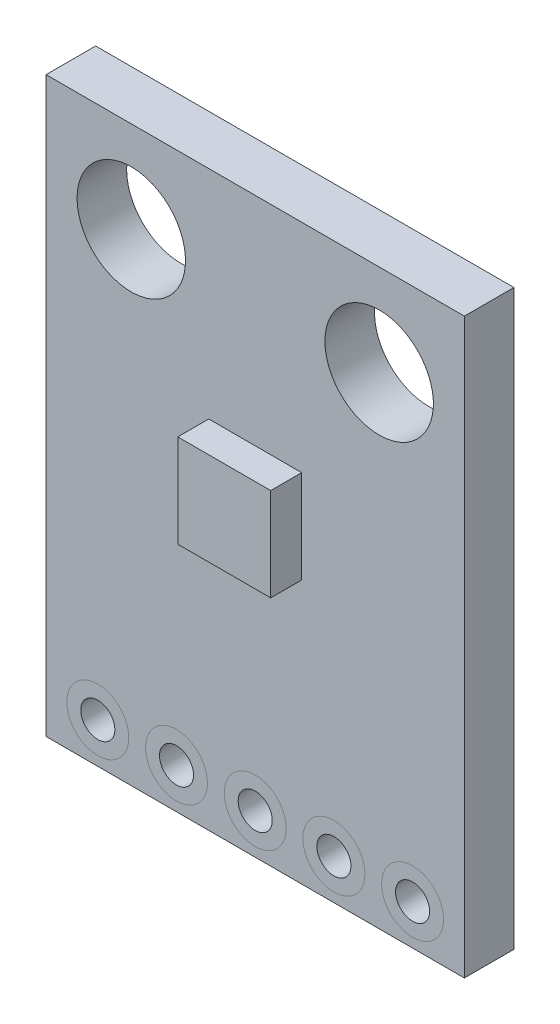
ISO-10303-21;
HEADER;
FILE_DESCRIPTION(('STEP AP214'),'2;1');
FILE_NAME('part.step','',(''),(''),'','','');
FILE_SCHEMA(('AUTOMOTIVE_DESIGN { 1 0 10303 214 1 1 1 1 }'));
ENDSEC;
DATA;
#1=APPLICATION_CONTEXT('core data for automotive mechanical design processes');
#2=APPLICATION_PROTOCOL_DEFINITION('international standard','automotive_design',2000,#1);
#3=PRODUCT_CONTEXT('',#1,'mechanical');
#4=PRODUCT('Part','Part','',(#3));
#5=PRODUCT_RELATED_PRODUCT_CATEGORY('part','',(#4));
#6=PRODUCT_DEFINITION_FORMATION('','',#4);
#7=PRODUCT_DEFINITION_CONTEXT('part definition',#1,'design');
#8=PRODUCT_DEFINITION('design','',#6,#7);
#9=PRODUCT_DEFINITION_SHAPE('','',#8);
#10=(LENGTH_UNIT() NAMED_UNIT(*) SI_UNIT(.MILLI.,.METRE.));
#11=(NAMED_UNIT(*) PLANE_ANGLE_UNIT() SI_UNIT($,.RADIAN.));
#12=(NAMED_UNIT(*) SI_UNIT($,.STERADIAN.) SOLID_ANGLE_UNIT());
#13=UNCERTAINTY_MEASURE_WITH_UNIT(LENGTH_MEASURE(1.E-05),#10,'distance_accuracy_value','');
#14=(GEOMETRIC_REPRESENTATION_CONTEXT(3) GLOBAL_UNCERTAINTY_ASSIGNED_CONTEXT((#13)) GLOBAL_UNIT_ASSIGNED_CONTEXT((#10,
#11,#12)) REPRESENTATION_CONTEXT('',''));
#15=CARTESIAN_POINT('',(0.,0.,0.));
#16=DIRECTION('',(0.,0.,1.));
#17=DIRECTION('',(1.,0.,0.));
#18=AXIS2_PLACEMENT_3D('',#15,#16,#17);
#19=CARTESIAN_POINT('',(13.7500001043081,29.7500005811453,-1.6));
#20=DIRECTION('',(0.,0.,1.));
#21=DIRECTION('',(1.,0.,0.));
#22=AXIS2_PLACEMENT_3D('',#19,#20,#21);
#23=PLANE('',#22);
#24=CARTESIAN_POINT('',(16.2900001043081,21.8000005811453,-1.6));
#25=DIRECTION('',(0.,0.,-1.));
#26=DIRECTION('',(-1.,0.,0.));
#27=AXIS2_PLACEMENT_3D('',#24,#25,#26);
#28=CIRCLE('',#27,1.);
#29=CARTESIAN_POINT('',(15.2900001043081,21.8000005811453,-1.6));
#30=VERTEX_POINT('',#29);
#31=EDGE_CURVE('P0_E99',#30,#30,#28,.F.);
#32=ORIENTED_EDGE('',*,*,#31,.T.);
#33=EDGE_LOOP('',(#32));
#34=FACE_BOUND('',#33,.T.);
#35=CARTESIAN_POINT('',(9.74999946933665,36.0499238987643,-1.6));
#36=DIRECTION('',(0.,0.,-1.));
#37=DIRECTION('',(-1.,0.,0.));
#38=AXIS2_PLACEMENT_3D('',#35,#36,#37);
#39=CIRCLE('',#38,1.75);
#40=CARTESIAN_POINT('',(7.99999946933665,36.0499238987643,-1.6));
#41=VERTEX_POINT('',#40);
#42=EDGE_CURVE('P0_E103',#41,#41,#39,.F.);
#43=ORIENTED_EDGE('',*,*,#42,.T.);
#44=EDGE_LOOP('',(#43));
#45=FACE_BOUND('',#44,.T.);
#46=CARTESIAN_POINT('',(11.2100001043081,21.8000005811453,-1.6));
#47=DIRECTION('',(0.,0.,-1.));
#48=DIRECTION('',(-1.,0.,0.));
#49=AXIS2_PLACEMENT_3D('',#46,#47,#48);
#50=CIRCLE('',#49,1.);
#51=CARTESIAN_POINT('',(10.2100001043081,21.8000005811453,-1.6));
#52=VERTEX_POINT('',#51);
#53=EDGE_CURVE('P0_E106',#52,#52,#50,.F.);
#54=ORIENTED_EDGE('',*,*,#53,.T.);
#55=EDGE_LOOP('',(#54));
#56=FACE_BOUND('',#55,.T.);
#57=CARTESIAN_POINT('',(8.67000010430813,21.8000005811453,-1.6));
#58=DIRECTION('',(0.,0.,-1.));
#59=DIRECTION('',(-1.,0.,0.));
#60=AXIS2_PLACEMENT_3D('',#57,#58,#59);
#61=CIRCLE('',#60,1.);
#62=CARTESIAN_POINT('',(7.67000010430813,21.8000005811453,-1.6));
#63=VERTEX_POINT('',#62);
#64=EDGE_CURVE('P0_E109',#63,#63,#61,.F.);
#65=ORIENTED_EDGE('',*,*,#64,.T.);
#66=EDGE_LOOP('',(#65));
#67=FACE_BOUND('',#66,.T.);
#68=CARTESIAN_POINT('',(17.7500001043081,36.0499230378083,-1.6));
#69=DIRECTION('',(0.,0.,-1.));
#70=DIRECTION('',(-1.,0.,0.));
#71=AXIS2_PLACEMENT_3D('',#68,#69,#70);
#72=CIRCLE('',#71,1.75);
#73=CARTESIAN_POINT('',(16.0000001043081,36.0499230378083,-1.6));
#74=VERTEX_POINT('',#73);
#75=EDGE_CURVE('P0_E112',#74,#74,#72,.F.);
#76=ORIENTED_EDGE('',*,*,#75,.T.);
#77=EDGE_LOOP('',(#76));
#78=FACE_BOUND('',#77,.T.);
#79=CARTESIAN_POINT('',(13.7500001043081,21.8000005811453,-1.6));
#80=DIRECTION('',(0.,0.,-1.));
#81=DIRECTION('',(-1.,0.,0.));
#82=AXIS2_PLACEMENT_3D('',#79,#80,#81);
#83=CIRCLE('',#82,1.);
#84=CARTESIAN_POINT('',(12.7500001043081,21.8000005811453,-1.6));
#85=VERTEX_POINT('',#84);
#86=EDGE_CURVE('P0_E114',#85,#85,#83,.F.);
#87=ORIENTED_EDGE('',*,*,#86,.T.);
#88=EDGE_LOOP('',(#87));
#89=FACE_BOUND('',#88,.T.);
#90=CARTESIAN_POINT('',(18.8300001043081,21.8000005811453,-1.6));
#91=DIRECTION('',(0.,0.,-1.));
#92=DIRECTION('',(-1.,0.,0.));
#93=AXIS2_PLACEMENT_3D('',#90,#91,#92);
#94=CIRCLE('',#93,1.);
#95=CARTESIAN_POINT('',(17.8300001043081,21.8000005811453,-1.6));
#96=VERTEX_POINT('',#95);
#97=EDGE_CURVE('P0_E20',#96,#96,#94,.F.);
#98=ORIENTED_EDGE('',*,*,#97,.T.);
#99=EDGE_LOOP('',(#98));
#100=FACE_BOUND('',#99,.T.);
#101=DIRECTION('',(0.,1.,0.));
#102=VECTOR('',#101,1.);
#103=CARTESIAN_POINT('',(7.00000010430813,20.5000005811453,-1.6));
#104=LINE('',#103,#102);
#105=CARTESIAN_POINT('',(7.00000010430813,39.0000002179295,-1.6));
#106=VERTEX_POINT('',#105);
#107=CARTESIAN_POINT('',(7.00000010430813,20.5000005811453,-1.6));
#108=VERTEX_POINT('',#107);
#109=EDGE_CURVE('P0_E121',#106,#108,#104,.F.);
#110=ORIENTED_EDGE('',*,*,#109,.F.);
#111=DIRECTION('',(-0.999999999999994,1.07619497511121E-07,0.));
#112=VECTOR('',#111,1.);
#113=CARTESIAN_POINT('',(7.00000010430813,39.0000005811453,-1.6));
#114=LINE('',#113,#112);
#115=CARTESIAN_POINT('',(20.5000001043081,38.9999991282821,-1.6));
#116=VERTEX_POINT('',#115);
#117=EDGE_CURVE('P0_E70',#116,#106,#114,.T.);
#118=ORIENTED_EDGE('',*,*,#117,.F.);
#119=DIRECTION('',(0.,1.,0.));
#120=VECTOR('',#119,1.);
#121=CARTESIAN_POINT('',(20.5000001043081,38.9999991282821,-1.6));
#122=LINE('',#121,#120);
#123=CARTESIAN_POINT('',(20.5000001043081,20.5000005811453,-1.6));
#124=VERTEX_POINT('',#123);
#125=EDGE_CURVE('P0_E55',#124,#116,#122,.T.);
#126=ORIENTED_EDGE('',*,*,#125,.F.);
#127=DIRECTION('',(1.,0.,0.));
#128=VECTOR('',#127,1.);
#129=CARTESIAN_POINT('',(20.5000001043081,20.5000005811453,-1.6));
#130=LINE('',#129,#128);
#131=EDGE_CURVE('P0_E60',#108,#124,#130,.T.);
#132=ORIENTED_EDGE('',*,*,#131,.F.);
#133=EDGE_LOOP('',(#110,#118,#126,#132));
#134=FACE_BOUND('',#133,.T.);
#135=ADVANCED_FACE('P0_F17',(#34,#45,#56,#67,#78,#89,#100,#134),#23,.F.);
#136=CARTESIAN_POINT('',(20.5000001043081,20.5000005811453,0.));
#137=DIRECTION('',(0.,-1.,0.));
#138=DIRECTION('',(0.,0.,-1.));
#139=AXIS2_PLACEMENT_3D('',#136,#137,#138);
#140=PLANE('',#139);
#141=ORIENTED_EDGE('',*,*,#131,.T.);
#142=DIRECTION('',(0.,0.,-1.));
#143=VECTOR('',#142,1.);
#144=CARTESIAN_POINT('',(20.5000001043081,20.5000005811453,0.));
#145=LINE('',#144,#143);
#146=CARTESIAN_POINT('',(20.5000001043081,20.5000005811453,0.));
#147=VERTEX_POINT('',#146);
#148=EDGE_CURVE('P0_E62',#147,#124,#145,.T.);
#149=ORIENTED_EDGE('',*,*,#148,.F.);
#150=DIRECTION('',(1.,0.,0.));
#151=VECTOR('',#150,1.);
#152=CARTESIAN_POINT('',(13.7500001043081,20.5000005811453,0.));
#153=LINE('',#152,#151);
#154=CARTESIAN_POINT('',(7.00000010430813,20.5000005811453,0.));
#155=VERTEX_POINT('',#154);
#156=EDGE_CURVE('P0_E102',#155,#147,#153,.T.);
#157=ORIENTED_EDGE('',*,*,#156,.F.);
#158=DIRECTION('',(0.,0.,1.));
#159=VECTOR('',#158,1.);
#160=CARTESIAN_POINT('',(7.00000010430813,20.5000005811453,0.));
#161=LINE('',#160,#159);
#162=EDGE_CURVE('P0_E65',#108,#155,#161,.T.);
#163=ORIENTED_EDGE('',*,*,#162,.F.);
#164=EDGE_LOOP('',(#141,#149,#157,#163));
#165=FACE_BOUND('',#164,.T.);
#166=ADVANCED_FACE('P0_F61',(#165),#140,.T.);
#167=CARTESIAN_POINT('',(20.5000001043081,38.9999991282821,0.));
#168=DIRECTION('',(1.,0.,0.));
#169=DIRECTION('',(0.,0.,-1.));
#170=AXIS2_PLACEMENT_3D('',#167,#168,#169);
#171=PLANE('',#170);
#172=ORIENTED_EDGE('',*,*,#125,.T.);
#173=DIRECTION('',(0.,0.,1.));
#174=VECTOR('',#173,1.);
#175=CARTESIAN_POINT('',(20.5000001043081,38.9999991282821,0.));
#176=LINE('',#175,#174);
#177=CARTESIAN_POINT('',(20.5000001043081,38.9999991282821,0.));
#178=VERTEX_POINT('',#177);
#179=EDGE_CURVE('P0_E72',#178,#116,#176,.F.);
#180=ORIENTED_EDGE('',*,*,#179,.F.);
#181=DIRECTION('',(0.,1.,0.));
#182=VECTOR('',#181,1.);
#183=CARTESIAN_POINT('',(20.5000001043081,29.7500005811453,0.));
#184=LINE('',#183,#182);
#185=EDGE_CURVE('P0_E76',#147,#178,#184,.T.);
#186=ORIENTED_EDGE('',*,*,#185,.F.);
#187=ORIENTED_EDGE('',*,*,#148,.T.);
#188=EDGE_LOOP('',(#172,#180,#186,#187));
#189=FACE_BOUND('',#188,.T.);
#190=ADVANCED_FACE('P0_F74',(#189),#171,.T.);
#191=CARTESIAN_POINT('',(7.00000010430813,39.0000005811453,0.));
#192=DIRECTION('',(1.07619497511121E-07,0.999999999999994,0.));
#193=DIRECTION('',(-0.999999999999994,1.07619497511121E-07,0.));
#194=AXIS2_PLACEMENT_3D('',#191,#192,#193);
#195=PLANE('',#194);
#196=ORIENTED_EDGE('',*,*,#117,.T.);
#197=DIRECTION('',(0.,0.,1.));
#198=VECTOR('',#197,1.);
#199=CARTESIAN_POINT('',(7.00000010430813,39.0000005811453,0.));
#200=LINE('',#199,#198);
#201=CARTESIAN_POINT('',(7.00000010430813,39.0000002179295,0.));
#202=VERTEX_POINT('',#201);
#203=EDGE_CURVE('P0_E35',#202,#106,#200,.F.);
#204=ORIENTED_EDGE('',*,*,#203,.F.);
#205=DIRECTION('',(1.,0.,0.));
#206=VECTOR('',#205,1.);
#207=CARTESIAN_POINT('',(13.7500001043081,38.9999991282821,0.));
#208=LINE('',#207,#206);
#209=EDGE_CURVE('P0_E132',#178,#202,#208,.F.);
#210=ORIENTED_EDGE('',*,*,#209,.F.);
#211=ORIENTED_EDGE('',*,*,#179,.T.);
#212=EDGE_LOOP('',(#196,#204,#210,#211));
#213=FACE_BOUND('',#212,.T.);
#214=ADVANCED_FACE('P0_F130',(#213),#195,.T.);
#215=CARTESIAN_POINT('',(7.00000010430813,20.5000005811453,0.));
#216=DIRECTION('',(-1.,0.,0.));
#217=DIRECTION('',(0.,0.,1.));
#218=AXIS2_PLACEMENT_3D('',#215,#216,#217);
#219=PLANE('',#218);
#220=ORIENTED_EDGE('',*,*,#109,.T.);
#221=ORIENTED_EDGE('',*,*,#162,.T.);
#222=DIRECTION('',(0.,1.,0.));
#223=VECTOR('',#222,1.);
#224=CARTESIAN_POINT('',(7.00000010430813,29.7500005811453,0.));
#225=LINE('',#224,#223);
#226=EDGE_CURVE('P0_E98',#202,#155,#225,.F.);
#227=ORIENTED_EDGE('',*,*,#226,.F.);
#228=ORIENTED_EDGE('',*,*,#203,.T.);
#229=EDGE_LOOP('',(#220,#221,#227,#228));
#230=FACE_BOUND('',#229,.T.);
#231=ADVANCED_FACE('P0_F137',(#230),#219,.T.);
#232=CARTESIAN_POINT('',(18.8300001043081,21.8000005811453,0.));
#233=DIRECTION('',(0.,0.,-1.));
#234=DIRECTION('',(-1.,0.,0.));
#235=AXIS2_PLACEMENT_3D('',#232,#233,#234);
#236=CYLINDRICAL_SURFACE('',#235,1.);
#237=CARTESIAN_POINT('',(18.8300001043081,21.8000005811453,0.));
#238=DIRECTION('',(0.,0.,-1.));
#239=DIRECTION('',(-1.,0.,0.));
#240=AXIS2_PLACEMENT_3D('',#237,#238,#239);
#241=CIRCLE('',#240,1.);
#242=CARTESIAN_POINT('',(17.8300001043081,21.8000005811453,0.));
#243=VERTEX_POINT('',#242);
#244=EDGE_CURVE('P0_E95',#243,#243,#241,.T.);
#245=ORIENTED_EDGE('',*,*,#244,.F.);
#246=EDGE_LOOP('',(#245));
#247=FACE_BOUND('',#246,.T.);
#248=ORIENTED_EDGE('',*,*,#97,.F.);
#249=EDGE_LOOP('',(#248));
#250=FACE_BOUND('',#249,.T.);
#251=ADVANCED_FACE('P0_F139',(#247,#250),#236,.F.);
#252=CARTESIAN_POINT('',(13.7500001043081,21.8000005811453,0.));
#253=DIRECTION('',(0.,0.,-1.));
#254=DIRECTION('',(-1.,0.,0.));
#255=AXIS2_PLACEMENT_3D('',#252,#253,#254);
#256=CYLINDRICAL_SURFACE('',#255,1.);
#257=CARTESIAN_POINT('',(13.7500001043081,21.8000005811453,0.));
#258=DIRECTION('',(0.,0.,-1.));
#259=DIRECTION('',(-1.,0.,0.));
#260=AXIS2_PLACEMENT_3D('',#257,#258,#259);
#261=CIRCLE('',#260,1.);
#262=CARTESIAN_POINT('',(12.7500001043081,21.8000005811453,0.));
#263=VERTEX_POINT('',#262);
#264=EDGE_CURVE('P0_E92',#263,#263,#261,.T.);
#265=ORIENTED_EDGE('',*,*,#264,.F.);
#266=EDGE_LOOP('',(#265));
#267=FACE_BOUND('',#266,.T.);
#268=ORIENTED_EDGE('',*,*,#86,.F.);
#269=EDGE_LOOP('',(#268));
#270=FACE_BOUND('',#269,.T.);
#271=ADVANCED_FACE('P0_F146',(#267,#270),#256,.F.);
#272=CARTESIAN_POINT('',(17.7500001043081,36.0499230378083,0.));
#273=DIRECTION('',(0.,0.,-1.));
#274=DIRECTION('',(-1.,0.,0.));
#275=AXIS2_PLACEMENT_3D('',#272,#273,#274);
#276=CYLINDRICAL_SURFACE('',#275,1.75);
#277=CARTESIAN_POINT('',(17.7500001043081,36.0499230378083,0.));
#278=DIRECTION('',(0.,0.,-1.));
#279=DIRECTION('',(-1.,0.,0.));
#280=AXIS2_PLACEMENT_3D('',#277,#278,#279);
#281=CIRCLE('',#280,1.75);
#282=CARTESIAN_POINT('',(16.0000001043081,36.0499230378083,0.));
#283=VERTEX_POINT('',#282);
#284=EDGE_CURVE('P0_E89',#283,#283,#281,.T.);
#285=ORIENTED_EDGE('',*,*,#284,.F.);
#286=EDGE_LOOP('',(#285));
#287=FACE_BOUND('',#286,.T.);
#288=ORIENTED_EDGE('',*,*,#75,.F.);
#289=EDGE_LOOP('',(#288));
#290=FACE_BOUND('',#289,.T.);
#291=ADVANCED_FACE('P0_F172',(#287,#290),#276,.F.);
#292=CARTESIAN_POINT('',(8.67000010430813,21.8000005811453,0.));
#293=DIRECTION('',(0.,0.,-1.));
#294=DIRECTION('',(-1.,0.,0.));
#295=AXIS2_PLACEMENT_3D('',#292,#293,#294);
#296=CYLINDRICAL_SURFACE('',#295,1.);
#297=CARTESIAN_POINT('',(8.67000010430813,21.8000005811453,0.));
#298=DIRECTION('',(0.,0.,-1.));
#299=DIRECTION('',(-1.,0.,0.));
#300=AXIS2_PLACEMENT_3D('',#297,#298,#299);
#301=CIRCLE('',#300,1.);
#302=CARTESIAN_POINT('',(7.67000010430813,21.8000005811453,0.));
#303=VERTEX_POINT('',#302);
#304=EDGE_CURVE('P0_E86',#303,#303,#301,.T.);
#305=ORIENTED_EDGE('',*,*,#304,.F.);
#306=EDGE_LOOP('',(#305));
#307=FACE_BOUND('',#306,.T.);
#308=ORIENTED_EDGE('',*,*,#64,.F.);
#309=EDGE_LOOP('',(#308));
#310=FACE_BOUND('',#309,.T.);
#311=ADVANCED_FACE('P0_F168',(#307,#310),#296,.F.);
#312=CARTESIAN_POINT('',(11.2100001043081,21.8000005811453,0.));
#313=DIRECTION('',(0.,0.,-1.));
#314=DIRECTION('',(-1.,0.,0.));
#315=AXIS2_PLACEMENT_3D('',#312,#313,#314);
#316=CYLINDRICAL_SURFACE('',#315,1.);
#317=CARTESIAN_POINT('',(11.2100001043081,21.8000005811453,0.));
#318=DIRECTION('',(0.,0.,-1.));
#319=DIRECTION('',(-1.,0.,0.));
#320=AXIS2_PLACEMENT_3D('',#317,#318,#319);
#321=CIRCLE('',#320,1.);
#322=CARTESIAN_POINT('',(10.2100001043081,21.8000005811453,0.));
#323=VERTEX_POINT('',#322);
#324=EDGE_CURVE('P0_E83',#323,#323,#321,.T.);
#325=ORIENTED_EDGE('',*,*,#324,.F.);
#326=EDGE_LOOP('',(#325));
#327=FACE_BOUND('',#326,.T.);
#328=ORIENTED_EDGE('',*,*,#53,.F.);
#329=EDGE_LOOP('',(#328));
#330=FACE_BOUND('',#329,.T.);
#331=ADVANCED_FACE('P0_F164',(#327,#330),#316,.F.);
#332=CARTESIAN_POINT('',(9.74999946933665,36.0499238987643,0.));
#333=DIRECTION('',(0.,0.,-1.));
#334=DIRECTION('',(-1.,0.,0.));
#335=AXIS2_PLACEMENT_3D('',#332,#333,#334);
#336=CYLINDRICAL_SURFACE('',#335,1.75);
#337=CARTESIAN_POINT('',(9.74999946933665,36.0499238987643,0.));
#338=DIRECTION('',(0.,0.,-1.));
#339=DIRECTION('',(-1.,0.,0.));
#340=AXIS2_PLACEMENT_3D('',#337,#338,#339);
#341=CIRCLE('',#340,1.75);
#342=CARTESIAN_POINT('',(7.99999946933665,36.0499238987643,0.));
#343=VERTEX_POINT('',#342);
#344=EDGE_CURVE('P0_E26',#343,#343,#341,.T.);
#345=ORIENTED_EDGE('',*,*,#344,.F.);
#346=EDGE_LOOP('',(#345));
#347=FACE_BOUND('',#346,.T.);
#348=ORIENTED_EDGE('',*,*,#42,.F.);
#349=EDGE_LOOP('',(#348));
#350=FACE_BOUND('',#349,.T.);
#351=ADVANCED_FACE('P0_F157',(#347,#350),#336,.F.);
#352=CARTESIAN_POINT('',(16.2900001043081,21.8000005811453,0.));
#353=DIRECTION('',(0.,0.,-1.));
#354=DIRECTION('',(-1.,0.,0.));
#355=AXIS2_PLACEMENT_3D('',#352,#353,#354);
#356=CYLINDRICAL_SURFACE('',#355,1.);
#357=CARTESIAN_POINT('',(16.2900001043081,21.8000005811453,0.));
#358=DIRECTION('',(0.,0.,-1.));
#359=DIRECTION('',(-1.,0.,0.));
#360=AXIS2_PLACEMENT_3D('',#357,#358,#359);
#361=CIRCLE('',#360,1.);
#362=CARTESIAN_POINT('',(15.2900001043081,21.8000005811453,0.));
#363=VERTEX_POINT('',#362);
#364=EDGE_CURVE('P0_E11',#363,#363,#361,.T.);
#365=ORIENTED_EDGE('',*,*,#364,.F.);
#366=EDGE_LOOP('',(#365));
#367=FACE_BOUND('',#366,.T.);
#368=ORIENTED_EDGE('',*,*,#31,.F.);
#369=EDGE_LOOP('',(#368));
#370=FACE_BOUND('',#369,.T.);
#371=ADVANCED_FACE('P0_F151',(#367,#370),#356,.F.);
#372=CARTESIAN_POINT('',(13.7500001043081,29.7500005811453,0.));
#373=DIRECTION('',(0.,0.,1.));
#374=DIRECTION('',(1.,0.,0.));
#375=AXIS2_PLACEMENT_3D('',#372,#373,#374);
#376=PLANE('',#375);
#377=ORIENTED_EDGE('',*,*,#364,.T.);
#378=EDGE_LOOP('',(#377));
#379=FACE_BOUND('',#378,.T.);
#380=ORIENTED_EDGE('',*,*,#344,.T.);
#381=EDGE_LOOP('',(#380));
#382=FACE_BOUND('',#381,.T.);
#383=ORIENTED_EDGE('',*,*,#324,.T.);
#384=EDGE_LOOP('',(#383));
#385=FACE_BOUND('',#384,.T.);
#386=ORIENTED_EDGE('',*,*,#304,.T.);
#387=EDGE_LOOP('',(#386));
#388=FACE_BOUND('',#387,.T.);
#389=ORIENTED_EDGE('',*,*,#284,.T.);
#390=EDGE_LOOP('',(#389));
#391=FACE_BOUND('',#390,.T.);
#392=ORIENTED_EDGE('',*,*,#264,.T.);
#393=EDGE_LOOP('',(#392));
#394=FACE_BOUND('',#393,.T.);
#395=ORIENTED_EDGE('',*,*,#244,.T.);
#396=EDGE_LOOP('',(#395));
#397=FACE_BOUND('',#396,.T.);
#398=ORIENTED_EDGE('',*,*,#209,.T.);
#399=ORIENTED_EDGE('',*,*,#226,.T.);
#400=ORIENTED_EDGE('',*,*,#156,.T.);
#401=ORIENTED_EDGE('',*,*,#185,.T.);
#402=EDGE_LOOP('',(#398,#399,#400,#401));
#403=FACE_BOUND('',#402,.T.);
#404=ADVANCED_FACE('P0_F135',(#379,#382,#385,#388,#391,#394,#397,#403),#376,.T.);
#405=CLOSED_SHELL('',(#135,#166,#190,#214,#231,#251,#271,#291,#311,#331,#351,#371,#404));
#406=MANIFOLD_SOLID_BREP('P0_B1',#405);
#407=CARTESIAN_POINT('',(13.7500001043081,21.8000005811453,0.));
#408=DIRECTION('',(0.,0.,-1.));
#409=DIRECTION('',(-1.,0.,0.));
#410=AXIS2_PLACEMENT_3D('',#407,#408,#409);
#411=CYLINDRICAL_SURFACE('',#410,0.549999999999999);
#412=CARTESIAN_POINT('',(13.7500001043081,21.8000005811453,0.));
#413=DIRECTION('',(0.,0.,-1.));
#414=DIRECTION('',(-1.,0.,0.));
#415=AXIS2_PLACEMENT_3D('',#412,#413,#414);
#416=CIRCLE('',#415,0.549999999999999);
#417=CARTESIAN_POINT('',(13.2000001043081,21.8000005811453,0.));
#418=VERTEX_POINT('',#417);
#419=EDGE_CURVE('P1_E27',#418,#418,#416,.T.);
#420=ORIENTED_EDGE('',*,*,#419,.F.);
#421=EDGE_LOOP('',(#420));
#422=FACE_BOUND('',#421,.T.);
#423=CARTESIAN_POINT('',(13.7500001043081,21.8000005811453,-1.6));
#424=DIRECTION('',(0.,0.,-1.));
#425=DIRECTION('',(-1.,0.,0.));
#426=AXIS2_PLACEMENT_3D('',#423,#424,#425);
#427=CIRCLE('',#426,0.549999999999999);
#428=CARTESIAN_POINT('',(13.2000001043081,21.8000005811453,-1.6));
#429=VERTEX_POINT('',#428);
#430=EDGE_CURVE('P1_E18',#429,#429,#427,.T.);
#431=ORIENTED_EDGE('',*,*,#430,.T.);
#432=EDGE_LOOP('',(#431));
#433=FACE_BOUND('',#432,.T.);
#434=ADVANCED_FACE('P1_F15',(#422,#433),#411,.F.);
#435=CARTESIAN_POINT('',(13.7500001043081,21.8000005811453,-1.6));
#436=DIRECTION('',(0.,0.,1.));
#437=DIRECTION('',(1.,0.,0.));
#438=AXIS2_PLACEMENT_3D('',#435,#436,#437);
#439=PLANE('',#438);
#440=ORIENTED_EDGE('',*,*,#430,.F.);
#441=EDGE_LOOP('',(#440));
#442=FACE_BOUND('',#441,.T.);
#443=CARTESIAN_POINT('',(13.7500001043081,21.8000005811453,-1.6));
#444=DIRECTION('',(0.,0.,-1.));
#445=DIRECTION('',(-1.,0.,0.));
#446=AXIS2_PLACEMENT_3D('',#443,#444,#445);
#447=CIRCLE('',#446,1.);
#448=CARTESIAN_POINT('',(12.7500001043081,21.8000005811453,-1.6));
#449=VERTEX_POINT('',#448);
#450=EDGE_CURVE('P1_E22',#449,#449,#447,.F.);
#451=ORIENTED_EDGE('',*,*,#450,.F.);
#452=EDGE_LOOP('',(#451));
#453=FACE_BOUND('',#452,.T.);
#454=ADVANCED_FACE('P1_F36',(#442,#453),#439,.F.);
#455=CARTESIAN_POINT('',(13.7500001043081,21.8000005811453,0.));
#456=DIRECTION('',(0.,0.,1.));
#457=DIRECTION('',(1.,0.,0.));
#458=AXIS2_PLACEMENT_3D('',#455,#456,#457);
#459=PLANE('',#458);
#460=ORIENTED_EDGE('',*,*,#419,.T.);
#461=EDGE_LOOP('',(#460));
#462=FACE_BOUND('',#461,.T.);
#463=CARTESIAN_POINT('',(13.7500001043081,21.8000005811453,0.));
#464=DIRECTION('',(0.,0.,-1.));
#465=DIRECTION('',(-1.,0.,0.));
#466=AXIS2_PLACEMENT_3D('',#463,#464,#465);
#467=CIRCLE('',#466,1.);
#468=CARTESIAN_POINT('',(12.7500001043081,21.8000005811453,0.));
#469=VERTEX_POINT('',#468);
#470=EDGE_CURVE('P1_E10',#469,#469,#467,.T.);
#471=ORIENTED_EDGE('',*,*,#470,.F.);
#472=EDGE_LOOP('',(#471));
#473=FACE_BOUND('',#472,.T.);
#474=ADVANCED_FACE('P1_F39',(#462,#473),#459,.T.);
#475=CARTESIAN_POINT('',(13.7500001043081,21.8000005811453,0.));
#476=DIRECTION('',(0.,0.,-1.));
#477=DIRECTION('',(-1.,0.,0.));
#478=AXIS2_PLACEMENT_3D('',#475,#476,#477);
#479=CYLINDRICAL_SURFACE('',#478,1.);
#480=ORIENTED_EDGE('',*,*,#470,.T.);
#481=EDGE_LOOP('',(#480));
#482=FACE_BOUND('',#481,.T.);
#483=ORIENTED_EDGE('',*,*,#450,.T.);
#484=EDGE_LOOP('',(#483));
#485=FACE_BOUND('',#484,.T.);
#486=ADVANCED_FACE('P1_F42',(#482,#485),#479,.T.);
#487=CLOSED_SHELL('',(#434,#454,#474,#486));
#488=MANIFOLD_SOLID_BREP('P1_B1',#487);
#489=CARTESIAN_POINT('',(11.2100001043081,21.8000005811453,0.));
#490=DIRECTION('',(0.,0.,-1.));
#491=DIRECTION('',(-1.,0.,0.));
#492=AXIS2_PLACEMENT_3D('',#489,#490,#491);
#493=CYLINDRICAL_SURFACE('',#492,0.549999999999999);
#494=CARTESIAN_POINT('',(11.2100001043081,21.8000005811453,0.));
#495=DIRECTION('',(0.,0.,-1.));
#496=DIRECTION('',(-1.,0.,0.));
#497=AXIS2_PLACEMENT_3D('',#494,#495,#496);
#498=CIRCLE('',#497,0.549999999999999);
#499=CARTESIAN_POINT('',(10.6600001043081,21.8000005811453,0.));
#500=VERTEX_POINT('',#499);
#501=EDGE_CURVE('P2_E27',#500,#500,#498,.T.);
#502=ORIENTED_EDGE('',*,*,#501,.F.);
#503=EDGE_LOOP('',(#502));
#504=FACE_BOUND('',#503,.T.);
#505=CARTESIAN_POINT('',(11.2100001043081,21.8000005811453,-1.6));
#506=DIRECTION('',(0.,0.,-1.));
#507=DIRECTION('',(-1.,0.,0.));
#508=AXIS2_PLACEMENT_3D('',#505,#506,#507);
#509=CIRCLE('',#508,0.549999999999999);
#510=CARTESIAN_POINT('',(10.6600001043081,21.8000005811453,-1.6));
#511=VERTEX_POINT('',#510);
#512=EDGE_CURVE('P2_E18',#511,#511,#509,.T.);
#513=ORIENTED_EDGE('',*,*,#512,.T.);
#514=EDGE_LOOP('',(#513));
#515=FACE_BOUND('',#514,.T.);
#516=ADVANCED_FACE('P2_F15',(#504,#515),#493,.F.);
#517=CARTESIAN_POINT('',(11.2100001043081,21.8000005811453,-1.6));
#518=DIRECTION('',(0.,0.,1.));
#519=DIRECTION('',(1.,0.,0.));
#520=AXIS2_PLACEMENT_3D('',#517,#518,#519);
#521=PLANE('',#520);
#522=ORIENTED_EDGE('',*,*,#512,.F.);
#523=EDGE_LOOP('',(#522));
#524=FACE_BOUND('',#523,.T.);
#525=CARTESIAN_POINT('',(11.2100001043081,21.8000005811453,-1.6));
#526=DIRECTION('',(0.,0.,-1.));
#527=DIRECTION('',(-1.,0.,0.));
#528=AXIS2_PLACEMENT_3D('',#525,#526,#527);
#529=CIRCLE('',#528,1.);
#530=CARTESIAN_POINT('',(10.2100001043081,21.8000005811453,-1.6));
#531=VERTEX_POINT('',#530);
#532=EDGE_CURVE('P2_E22',#531,#531,#529,.F.);
#533=ORIENTED_EDGE('',*,*,#532,.F.);
#534=EDGE_LOOP('',(#533));
#535=FACE_BOUND('',#534,.T.);
#536=ADVANCED_FACE('P2_F36',(#524,#535),#521,.F.);
#537=CARTESIAN_POINT('',(11.2100001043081,21.8000005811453,0.));
#538=DIRECTION('',(0.,0.,1.));
#539=DIRECTION('',(1.,0.,0.));
#540=AXIS2_PLACEMENT_3D('',#537,#538,#539);
#541=PLANE('',#540);
#542=ORIENTED_EDGE('',*,*,#501,.T.);
#543=EDGE_LOOP('',(#542));
#544=FACE_BOUND('',#543,.T.);
#545=CARTESIAN_POINT('',(11.2100001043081,21.8000005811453,0.));
#546=DIRECTION('',(0.,0.,-1.));
#547=DIRECTION('',(-1.,0.,0.));
#548=AXIS2_PLACEMENT_3D('',#545,#546,#547);
#549=CIRCLE('',#548,1.);
#550=CARTESIAN_POINT('',(10.2100001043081,21.8000005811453,0.));
#551=VERTEX_POINT('',#550);
#552=EDGE_CURVE('P2_E10',#551,#551,#549,.T.);
#553=ORIENTED_EDGE('',*,*,#552,.F.);
#554=EDGE_LOOP('',(#553));
#555=FACE_BOUND('',#554,.T.);
#556=ADVANCED_FACE('P2_F39',(#544,#555),#541,.T.);
#557=CARTESIAN_POINT('',(11.2100001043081,21.8000005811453,0.));
#558=DIRECTION('',(0.,0.,-1.));
#559=DIRECTION('',(-1.,0.,0.));
#560=AXIS2_PLACEMENT_3D('',#557,#558,#559);
#561=CYLINDRICAL_SURFACE('',#560,1.);
#562=ORIENTED_EDGE('',*,*,#552,.T.);
#563=EDGE_LOOP('',(#562));
#564=FACE_BOUND('',#563,.T.);
#565=ORIENTED_EDGE('',*,*,#532,.T.);
#566=EDGE_LOOP('',(#565));
#567=FACE_BOUND('',#566,.T.);
#568=ADVANCED_FACE('P2_F42',(#564,#567),#561,.T.);
#569=CLOSED_SHELL('',(#516,#536,#556,#568));
#570=MANIFOLD_SOLID_BREP('P2_B1',#569);
#571=CARTESIAN_POINT('',(8.67000010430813,21.8000005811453,0.));
#572=DIRECTION('',(0.,0.,-1.));
#573=DIRECTION('',(-1.,0.,0.));
#574=AXIS2_PLACEMENT_3D('',#571,#572,#573);
#575=CYLINDRICAL_SURFACE('',#574,0.549999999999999);
#576=CARTESIAN_POINT('',(8.67000010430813,21.8000005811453,0.));
#577=DIRECTION('',(0.,0.,-1.));
#578=DIRECTION('',(-1.,0.,0.));
#579=AXIS2_PLACEMENT_3D('',#576,#577,#578);
#580=CIRCLE('',#579,0.549999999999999);
#581=CARTESIAN_POINT('',(8.12000010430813,21.8000005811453,0.));
#582=VERTEX_POINT('',#581);
#583=EDGE_CURVE('P3_E27',#582,#582,#580,.T.);
#584=ORIENTED_EDGE('',*,*,#583,.F.);
#585=EDGE_LOOP('',(#584));
#586=FACE_BOUND('',#585,.T.);
#587=CARTESIAN_POINT('',(8.67000010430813,21.8000005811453,-1.6));
#588=DIRECTION('',(0.,0.,-1.));
#589=DIRECTION('',(-1.,0.,0.));
#590=AXIS2_PLACEMENT_3D('',#587,#588,#589);
#591=CIRCLE('',#590,0.549999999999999);
#592=CARTESIAN_POINT('',(8.12000010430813,21.8000005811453,-1.6));
#593=VERTEX_POINT('',#592);
#594=EDGE_CURVE('P3_E18',#593,#593,#591,.T.);
#595=ORIENTED_EDGE('',*,*,#594,.T.);
#596=EDGE_LOOP('',(#595));
#597=FACE_BOUND('',#596,.T.);
#598=ADVANCED_FACE('P3_F15',(#586,#597),#575,.F.);
#599=CARTESIAN_POINT('',(8.67000010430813,21.8000005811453,-1.6));
#600=DIRECTION('',(0.,0.,1.));
#601=DIRECTION('',(1.,0.,0.));
#602=AXIS2_PLACEMENT_3D('',#599,#600,#601);
#603=PLANE('',#602);
#604=ORIENTED_EDGE('',*,*,#594,.F.);
#605=EDGE_LOOP('',(#604));
#606=FACE_BOUND('',#605,.T.);
#607=CARTESIAN_POINT('',(8.67000010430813,21.8000005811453,-1.6));
#608=DIRECTION('',(0.,0.,-1.));
#609=DIRECTION('',(-1.,0.,0.));
#610=AXIS2_PLACEMENT_3D('',#607,#608,#609);
#611=CIRCLE('',#610,1.);
#612=CARTESIAN_POINT('',(7.67000010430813,21.8000005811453,-1.6));
#613=VERTEX_POINT('',#612);
#614=EDGE_CURVE('P3_E22',#613,#613,#611,.F.);
#615=ORIENTED_EDGE('',*,*,#614,.F.);
#616=EDGE_LOOP('',(#615));
#617=FACE_BOUND('',#616,.T.);
#618=ADVANCED_FACE('P3_F36',(#606,#617),#603,.F.);
#619=CARTESIAN_POINT('',(8.67000010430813,21.8000005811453,0.));
#620=DIRECTION('',(0.,0.,1.));
#621=DIRECTION('',(1.,0.,0.));
#622=AXIS2_PLACEMENT_3D('',#619,#620,#621);
#623=PLANE('',#622);
#624=ORIENTED_EDGE('',*,*,#583,.T.);
#625=EDGE_LOOP('',(#624));
#626=FACE_BOUND('',#625,.T.);
#627=CARTESIAN_POINT('',(8.67000010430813,21.8000005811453,0.));
#628=DIRECTION('',(0.,0.,-1.));
#629=DIRECTION('',(-1.,0.,0.));
#630=AXIS2_PLACEMENT_3D('',#627,#628,#629);
#631=CIRCLE('',#630,1.);
#632=CARTESIAN_POINT('',(7.67000010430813,21.8000005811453,0.));
#633=VERTEX_POINT('',#632);
#634=EDGE_CURVE('P3_E10',#633,#633,#631,.T.);
#635=ORIENTED_EDGE('',*,*,#634,.F.);
#636=EDGE_LOOP('',(#635));
#637=FACE_BOUND('',#636,.T.);
#638=ADVANCED_FACE('P3_F39',(#626,#637),#623,.T.);
#639=CARTESIAN_POINT('',(8.67000010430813,21.8000005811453,0.));
#640=DIRECTION('',(0.,0.,-1.));
#641=DIRECTION('',(-1.,0.,0.));
#642=AXIS2_PLACEMENT_3D('',#639,#640,#641);
#643=CYLINDRICAL_SURFACE('',#642,1.);
#644=ORIENTED_EDGE('',*,*,#634,.T.);
#645=EDGE_LOOP('',(#644));
#646=FACE_BOUND('',#645,.T.);
#647=ORIENTED_EDGE('',*,*,#614,.T.);
#648=EDGE_LOOP('',(#647));
#649=FACE_BOUND('',#648,.T.);
#650=ADVANCED_FACE('P3_F42',(#646,#649),#643,.T.);
#651=CLOSED_SHELL('',(#598,#618,#638,#650));
#652=MANIFOLD_SOLID_BREP('P3_B1',#651);
#653=CARTESIAN_POINT('',(16.2900001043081,21.8000005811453,0.));
#654=DIRECTION('',(0.,0.,-1.));
#655=DIRECTION('',(-1.,0.,0.));
#656=AXIS2_PLACEMENT_3D('',#653,#654,#655);
#657=CYLINDRICAL_SURFACE('',#656,0.549999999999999);
#658=CARTESIAN_POINT('',(16.2900001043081,21.8000005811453,0.));
#659=DIRECTION('',(0.,0.,-1.));
#660=DIRECTION('',(-1.,0.,0.));
#661=AXIS2_PLACEMENT_3D('',#658,#659,#660);
#662=CIRCLE('',#661,0.549999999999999);
#663=CARTESIAN_POINT('',(15.7400001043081,21.8000005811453,0.));
#664=VERTEX_POINT('',#663);
#665=EDGE_CURVE('P4_E27',#664,#664,#662,.T.);
#666=ORIENTED_EDGE('',*,*,#665,.F.);
#667=EDGE_LOOP('',(#666));
#668=FACE_BOUND('',#667,.T.);
#669=CARTESIAN_POINT('',(16.2900001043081,21.8000005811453,-1.6));
#670=DIRECTION('',(0.,0.,-1.));
#671=DIRECTION('',(-1.,0.,0.));
#672=AXIS2_PLACEMENT_3D('',#669,#670,#671);
#673=CIRCLE('',#672,0.549999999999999);
#674=CARTESIAN_POINT('',(15.7400001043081,21.8000005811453,-1.6));
#675=VERTEX_POINT('',#674);
#676=EDGE_CURVE('P4_E18',#675,#675,#673,.T.);
#677=ORIENTED_EDGE('',*,*,#676,.T.);
#678=EDGE_LOOP('',(#677));
#679=FACE_BOUND('',#678,.T.);
#680=ADVANCED_FACE('P4_F15',(#668,#679),#657,.F.);
#681=CARTESIAN_POINT('',(16.2900001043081,21.8000005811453,-1.6));
#682=DIRECTION('',(0.,0.,1.));
#683=DIRECTION('',(1.,0.,0.));
#684=AXIS2_PLACEMENT_3D('',#681,#682,#683);
#685=PLANE('',#684);
#686=ORIENTED_EDGE('',*,*,#676,.F.);
#687=EDGE_LOOP('',(#686));
#688=FACE_BOUND('',#687,.T.);
#689=CARTESIAN_POINT('',(16.2900001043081,21.8000005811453,-1.6));
#690=DIRECTION('',(0.,0.,-1.));
#691=DIRECTION('',(-1.,0.,0.));
#692=AXIS2_PLACEMENT_3D('',#689,#690,#691);
#693=CIRCLE('',#692,1.);
#694=CARTESIAN_POINT('',(15.2900001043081,21.8000005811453,-1.6));
#695=VERTEX_POINT('',#694);
#696=EDGE_CURVE('P4_E22',#695,#695,#693,.F.);
#697=ORIENTED_EDGE('',*,*,#696,.F.);
#698=EDGE_LOOP('',(#697));
#699=FACE_BOUND('',#698,.T.);
#700=ADVANCED_FACE('P4_F36',(#688,#699),#685,.F.);
#701=CARTESIAN_POINT('',(16.2900001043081,21.8000005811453,0.));
#702=DIRECTION('',(0.,0.,1.));
#703=DIRECTION('',(1.,0.,0.));
#704=AXIS2_PLACEMENT_3D('',#701,#702,#703);
#705=PLANE('',#704);
#706=ORIENTED_EDGE('',*,*,#665,.T.);
#707=EDGE_LOOP('',(#706));
#708=FACE_BOUND('',#707,.T.);
#709=CARTESIAN_POINT('',(16.2900001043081,21.8000005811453,0.));
#710=DIRECTION('',(0.,0.,-1.));
#711=DIRECTION('',(-1.,0.,0.));
#712=AXIS2_PLACEMENT_3D('',#709,#710,#711);
#713=CIRCLE('',#712,1.);
#714=CARTESIAN_POINT('',(15.2900001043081,21.8000005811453,0.));
#715=VERTEX_POINT('',#714);
#716=EDGE_CURVE('P4_E10',#715,#715,#713,.T.);
#717=ORIENTED_EDGE('',*,*,#716,.F.);
#718=EDGE_LOOP('',(#717));
#719=FACE_BOUND('',#718,.T.);
#720=ADVANCED_FACE('P4_F39',(#708,#719),#705,.T.);
#721=CARTESIAN_POINT('',(16.2900001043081,21.8000005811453,0.));
#722=DIRECTION('',(0.,0.,-1.));
#723=DIRECTION('',(-1.,0.,0.));
#724=AXIS2_PLACEMENT_3D('',#721,#722,#723);
#725=CYLINDRICAL_SURFACE('',#724,1.);
#726=ORIENTED_EDGE('',*,*,#716,.T.);
#727=EDGE_LOOP('',(#726));
#728=FACE_BOUND('',#727,.T.);
#729=ORIENTED_EDGE('',*,*,#696,.T.);
#730=EDGE_LOOP('',(#729));
#731=FACE_BOUND('',#730,.T.);
#732=ADVANCED_FACE('P4_F42',(#728,#731),#725,.T.);
#733=CLOSED_SHELL('',(#680,#700,#720,#732));
#734=MANIFOLD_SOLID_BREP('P4_B1',#733);
#735=CARTESIAN_POINT('',(13.7499993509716,30.4999998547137,0.));
#736=DIRECTION('',(0.,0.,1.));
#737=DIRECTION('',(1.,0.,0.));
#738=AXIS2_PLACEMENT_3D('',#735,#736,#737);
#739=PLANE('',#738);
#740=DIRECTION('',(0.,1.,0.));
#741=VECTOR('',#740,1.);
#742=CARTESIAN_POINT('',(12.2499993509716,31.9999998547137,0.));
#743=LINE('',#742,#741);
#744=CARTESIAN_POINT('',(12.2499993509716,31.9999998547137,0.));
#745=VERTEX_POINT('',#744);
#746=CARTESIAN_POINT('',(12.2499993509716,28.9999998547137,0.));
#747=VERTEX_POINT('',#746);
#748=EDGE_CURVE('P5_E79',#745,#747,#743,.F.);
#749=ORIENTED_EDGE('',*,*,#748,.F.);
#750=DIRECTION('',(1.,0.,0.));
#751=VECTOR('',#750,1.);
#752=CARTESIAN_POINT('',(15.2499993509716,31.9999998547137,0.));
#753=LINE('',#752,#751);
#754=CARTESIAN_POINT('',(15.2499993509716,31.9999998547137,0.));
#755=VERTEX_POINT('',#754);
#756=EDGE_CURVE('P5_E55',#755,#745,#753,.F.);
#757=ORIENTED_EDGE('',*,*,#756,.F.);
#758=DIRECTION('',(0.,1.,0.));
#759=VECTOR('',#758,1.);
#760=CARTESIAN_POINT('',(15.2499993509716,28.9999998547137,0.));
#761=LINE('',#760,#759);
#762=CARTESIAN_POINT('',(15.2499993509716,28.9999998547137,0.));
#763=VERTEX_POINT('',#762);
#764=EDGE_CURVE('P5_E57',#763,#755,#761,.T.);
#765=ORIENTED_EDGE('',*,*,#764,.F.);
#766=DIRECTION('',(1.,0.,0.));
#767=VECTOR('',#766,1.);
#768=CARTESIAN_POINT('',(12.2499993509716,28.9999998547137,0.));
#769=LINE('',#768,#767);
#770=EDGE_CURVE('P5_E20',#747,#763,#769,.T.);
#771=ORIENTED_EDGE('',*,*,#770,.F.);
#772=EDGE_LOOP('',(#749,#757,#765,#771));
#773=FACE_BOUND('',#772,.T.);
#774=ADVANCED_FACE('P5_F17',(#773),#739,.F.);
#775=CARTESIAN_POINT('',(12.2499993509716,28.9999998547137,0.));
#776=DIRECTION('',(0.,-1.,0.));
#777=DIRECTION('',(0.,0.,-1.));
#778=AXIS2_PLACEMENT_3D('',#775,#776,#777);
#779=PLANE('',#778);
#780=DIRECTION('',(1.,0.,0.));
#781=VECTOR('',#780,1.);
#782=CARTESIAN_POINT('',(13.7499993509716,28.9999998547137,1.));
#783=LINE('',#782,#781);
#784=CARTESIAN_POINT('',(12.2499993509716,28.9999998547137,1.));
#785=VERTEX_POINT('',#784);
#786=CARTESIAN_POINT('',(15.2499993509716,28.9999998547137,1.));
#787=VERTEX_POINT('',#786);
#788=EDGE_CURVE('P5_E83',#785,#787,#783,.T.);
#789=ORIENTED_EDGE('',*,*,#788,.F.);
#790=DIRECTION('',(0.,0.,1.));
#791=VECTOR('',#790,1.);
#792=CARTESIAN_POINT('',(12.2499993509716,28.9999998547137,0.));
#793=LINE('',#792,#791);
#794=EDGE_CURVE('P5_E68',#747,#785,#793,.T.);
#795=ORIENTED_EDGE('',*,*,#794,.F.);
#796=ORIENTED_EDGE('',*,*,#770,.T.);
#797=DIRECTION('',(0.,0.,-1.));
#798=VECTOR('',#797,1.);
#799=CARTESIAN_POINT('',(15.2499993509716,28.9999998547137,0.));
#800=LINE('',#799,#798);
#801=EDGE_CURVE('P5_E63',#787,#763,#800,.T.);
#802=ORIENTED_EDGE('',*,*,#801,.F.);
#803=EDGE_LOOP('',(#789,#795,#796,#802));
#804=FACE_BOUND('',#803,.T.);
#805=ADVANCED_FACE('P5_F65',(#804),#779,.T.);
#806=CARTESIAN_POINT('',(15.2499993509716,28.9999998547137,0.));
#807=DIRECTION('',(1.,0.,0.));
#808=DIRECTION('',(0.,0.,-1.));
#809=AXIS2_PLACEMENT_3D('',#806,#807,#808);
#810=PLANE('',#809);
#811=DIRECTION('',(0.,1.,0.));
#812=VECTOR('',#811,1.);
#813=CARTESIAN_POINT('',(15.2499993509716,30.4999998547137,1.));
#814=LINE('',#813,#812);
#815=CARTESIAN_POINT('',(15.2499993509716,31.9999998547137,1.));
#816=VERTEX_POINT('',#815);
#817=EDGE_CURVE('P5_E72',#787,#816,#814,.T.);
#818=ORIENTED_EDGE('',*,*,#817,.F.);
#819=ORIENTED_EDGE('',*,*,#801,.T.);
#820=ORIENTED_EDGE('',*,*,#764,.T.);
#821=DIRECTION('',(0.,0.,1.));
#822=VECTOR('',#821,1.);
#823=CARTESIAN_POINT('',(15.2499993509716,31.9999998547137,0.));
#824=LINE('',#823,#822);
#825=EDGE_CURVE('P5_E75',#816,#755,#824,.F.);
#826=ORIENTED_EDGE('',*,*,#825,.F.);
#827=EDGE_LOOP('',(#818,#819,#820,#826));
#828=FACE_BOUND('',#827,.T.);
#829=ADVANCED_FACE('P5_F70',(#828),#810,.T.);
#830=CARTESIAN_POINT('',(15.2499993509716,31.9999998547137,0.));
#831=DIRECTION('',(0.,1.,0.));
#832=DIRECTION('',(0.,0.,1.));
#833=AXIS2_PLACEMENT_3D('',#830,#831,#832);
#834=PLANE('',#833);
#835=DIRECTION('',(1.,0.,0.));
#836=VECTOR('',#835,1.);
#837=CARTESIAN_POINT('',(13.7499993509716,31.9999998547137,1.));
#838=LINE('',#837,#836);
#839=CARTESIAN_POINT('',(12.2499993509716,31.9999998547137,1.));
#840=VERTEX_POINT('',#839);
#841=EDGE_CURVE('P5_E26',#816,#840,#838,.F.);
#842=ORIENTED_EDGE('',*,*,#841,.F.);
#843=ORIENTED_EDGE('',*,*,#825,.T.);
#844=ORIENTED_EDGE('',*,*,#756,.T.);
#845=DIRECTION('',(0.,0.,1.));
#846=VECTOR('',#845,1.);
#847=CARTESIAN_POINT('',(12.2499993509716,31.9999998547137,0.));
#848=LINE('',#847,#846);
#849=EDGE_CURVE('P5_E35',#840,#745,#848,.F.);
#850=ORIENTED_EDGE('',*,*,#849,.F.);
#851=EDGE_LOOP('',(#842,#843,#844,#850));
#852=FACE_BOUND('',#851,.T.);
#853=ADVANCED_FACE('P5_F89',(#852),#834,.T.);
#854=CARTESIAN_POINT('',(12.2499993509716,31.9999998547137,0.));
#855=DIRECTION('',(-1.,0.,0.));
#856=DIRECTION('',(0.,0.,1.));
#857=AXIS2_PLACEMENT_3D('',#854,#855,#856);
#858=PLANE('',#857);
#859=DIRECTION('',(0.,1.,0.));
#860=VECTOR('',#859,1.);
#861=CARTESIAN_POINT('',(12.2499993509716,30.4999998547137,1.));
#862=LINE('',#861,#860);
#863=EDGE_CURVE('P5_E11',#840,#785,#862,.F.);
#864=ORIENTED_EDGE('',*,*,#863,.F.);
#865=ORIENTED_EDGE('',*,*,#849,.T.);
#866=ORIENTED_EDGE('',*,*,#748,.T.);
#867=ORIENTED_EDGE('',*,*,#794,.T.);
#868=EDGE_LOOP('',(#864,#865,#866,#867));
#869=FACE_BOUND('',#868,.T.);
#870=ADVANCED_FACE('P5_F91',(#869),#858,.T.);
#871=CARTESIAN_POINT('',(13.7499993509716,30.4999998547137,1.));
#872=DIRECTION('',(0.,0.,1.));
#873=DIRECTION('',(1.,0.,0.));
#874=AXIS2_PLACEMENT_3D('',#871,#872,#873);
#875=PLANE('',#874);
#876=ORIENTED_EDGE('',*,*,#841,.T.);
#877=ORIENTED_EDGE('',*,*,#863,.T.);
#878=ORIENTED_EDGE('',*,*,#788,.T.);
#879=ORIENTED_EDGE('',*,*,#817,.T.);
#880=EDGE_LOOP('',(#876,#877,#878,#879));
#881=FACE_BOUND('',#880,.T.);
#882=ADVANCED_FACE('P5_F88',(#881),#875,.T.);
#883=CLOSED_SHELL('',(#774,#805,#829,#853,#870,#882));
#884=MANIFOLD_SOLID_BREP('P5_B1',#883);
#885=CARTESIAN_POINT('',(18.8300001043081,21.8000005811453,0.));
#886=DIRECTION('',(0.,0.,-1.));
#887=DIRECTION('',(-1.,0.,0.));
#888=AXIS2_PLACEMENT_3D('',#885,#886,#887);
#889=CYLINDRICAL_SURFACE('',#888,0.549999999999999);
#890=CARTESIAN_POINT('',(18.8300001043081,21.8000005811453,0.));
#891=DIRECTION('',(0.,0.,-1.));
#892=DIRECTION('',(-1.,0.,0.));
#893=AXIS2_PLACEMENT_3D('',#890,#891,#892);
#894=CIRCLE('',#893,0.549999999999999);
#895=CARTESIAN_POINT('',(18.2800001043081,21.8000005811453,0.));
#896=VERTEX_POINT('',#895);
#897=EDGE_CURVE('P6_E27',#896,#896,#894,.T.);
#898=ORIENTED_EDGE('',*,*,#897,.F.);
#899=EDGE_LOOP('',(#898));
#900=FACE_BOUND('',#899,.T.);
#901=CARTESIAN_POINT('',(18.8300001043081,21.8000005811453,-1.6));
#902=DIRECTION('',(0.,0.,-1.));
#903=DIRECTION('',(-1.,0.,0.));
#904=AXIS2_PLACEMENT_3D('',#901,#902,#903);
#905=CIRCLE('',#904,0.549999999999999);
#906=CARTESIAN_POINT('',(18.2800001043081,21.8000005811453,-1.6));
#907=VERTEX_POINT('',#906);
#908=EDGE_CURVE('P6_E18',#907,#907,#905,.T.);
#909=ORIENTED_EDGE('',*,*,#908,.T.);
#910=EDGE_LOOP('',(#909));
#911=FACE_BOUND('',#910,.T.);
#912=ADVANCED_FACE('P6_F15',(#900,#911),#889,.F.);
#913=CARTESIAN_POINT('',(18.8300001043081,21.8000005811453,-1.6));
#914=DIRECTION('',(0.,0.,1.));
#915=DIRECTION('',(1.,0.,0.));
#916=AXIS2_PLACEMENT_3D('',#913,#914,#915);
#917=PLANE('',#916);
#918=ORIENTED_EDGE('',*,*,#908,.F.);
#919=EDGE_LOOP('',(#918));
#920=FACE_BOUND('',#919,.T.);
#921=CARTESIAN_POINT('',(18.8300001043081,21.8000005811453,-1.6));
#922=DIRECTION('',(0.,0.,-1.));
#923=DIRECTION('',(-1.,0.,0.));
#924=AXIS2_PLACEMENT_3D('',#921,#922,#923);
#925=CIRCLE('',#924,1.);
#926=CARTESIAN_POINT('',(17.8300001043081,21.8000005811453,-1.6));
#927=VERTEX_POINT('',#926);
#928=EDGE_CURVE('P6_E22',#927,#927,#925,.F.);
#929=ORIENTED_EDGE('',*,*,#928,.F.);
#930=EDGE_LOOP('',(#929));
#931=FACE_BOUND('',#930,.T.);
#932=ADVANCED_FACE('P6_F36',(#920,#931),#917,.F.);
#933=CARTESIAN_POINT('',(18.8300001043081,21.8000005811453,0.));
#934=DIRECTION('',(0.,0.,1.));
#935=DIRECTION('',(1.,0.,0.));
#936=AXIS2_PLACEMENT_3D('',#933,#934,#935);
#937=PLANE('',#936);
#938=ORIENTED_EDGE('',*,*,#897,.T.);
#939=EDGE_LOOP('',(#938));
#940=FACE_BOUND('',#939,.T.);
#941=CARTESIAN_POINT('',(18.8300001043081,21.8000005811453,0.));
#942=DIRECTION('',(0.,0.,-1.));
#943=DIRECTION('',(-1.,0.,0.));
#944=AXIS2_PLACEMENT_3D('',#941,#942,#943);
#945=CIRCLE('',#944,1.);
#946=CARTESIAN_POINT('',(17.8300001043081,21.8000005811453,0.));
#947=VERTEX_POINT('',#946);
#948=EDGE_CURVE('P6_E10',#947,#947,#945,.T.);
#949=ORIENTED_EDGE('',*,*,#948,.F.);
#950=EDGE_LOOP('',(#949));
#951=FACE_BOUND('',#950,.T.);
#952=ADVANCED_FACE('P6_F39',(#940,#951),#937,.T.);
#953=CARTESIAN_POINT('',(18.8300001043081,21.8000005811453,0.));
#954=DIRECTION('',(0.,0.,-1.));
#955=DIRECTION('',(-1.,0.,0.));
#956=AXIS2_PLACEMENT_3D('',#953,#954,#955);
#957=CYLINDRICAL_SURFACE('',#956,1.);
#958=ORIENTED_EDGE('',*,*,#948,.T.);
#959=EDGE_LOOP('',(#958));
#960=FACE_BOUND('',#959,.T.);
#961=ORIENTED_EDGE('',*,*,#928,.T.);
#962=EDGE_LOOP('',(#961));
#963=FACE_BOUND('',#962,.T.);
#964=ADVANCED_FACE('P6_F42',(#960,#963),#957,.T.);
#965=CLOSED_SHELL('',(#912,#932,#952,#964));
#966=MANIFOLD_SOLID_BREP('P6_B1',#965);
#967=ADVANCED_BREP_SHAPE_REPRESENTATION('',(#18,#406,#488,#570,#652,#734,#884,#966),#14);
#968=SHAPE_DEFINITION_REPRESENTATION(#9,#967);
ENDSEC;
END-ISO-10303-21;
